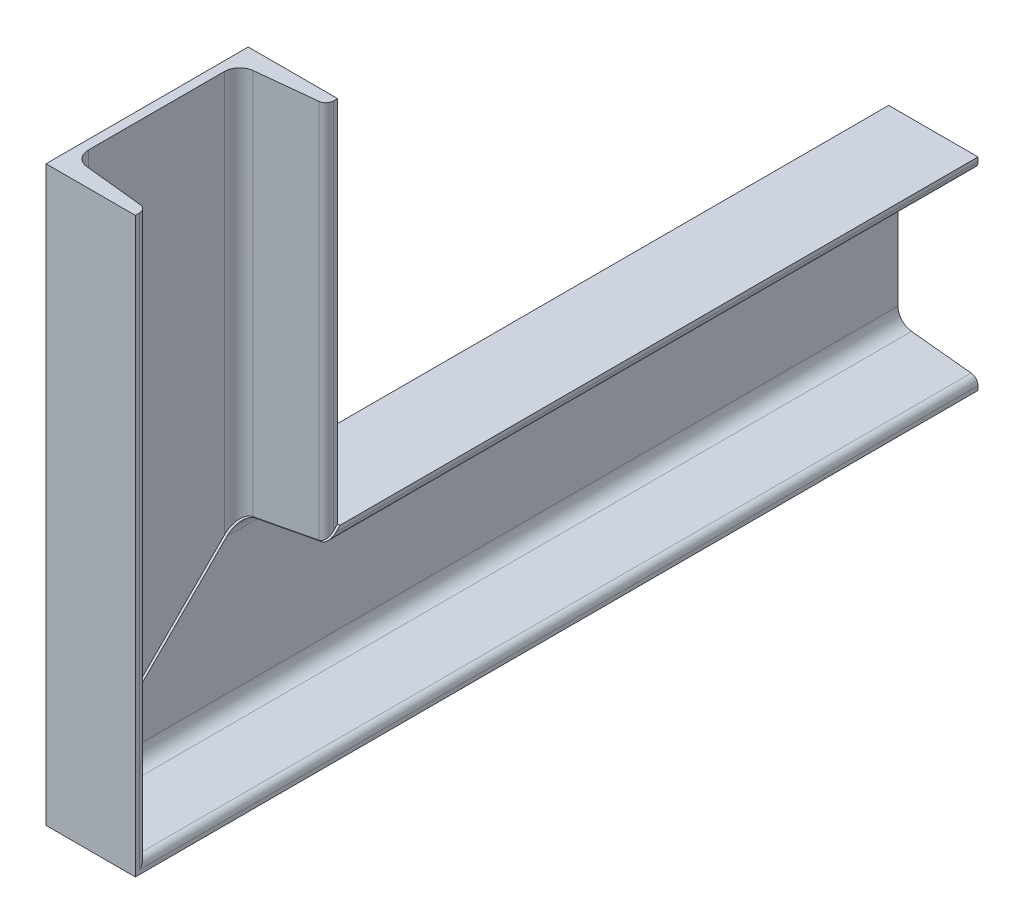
from build123d import *

# Parameters (mm, degrees)
EXTRUDE_1_DEPTH     = 500
EXTRUDE_2_DEPTH     = 340
CUT_EXTRUDE_1_DEPTH = 450
CUT_EXTRUDE_START   = -50
CUT_EXTRUDE_2_DEPTH = 50
CUT_EXTRUDE_3_DEPTH = 60


with BuildPart() as part:
    # Sketch 1 → Extrude 1 (new body)
    with BuildSketch(Plane.XY):
        with BuildLine():
            Line((0, 60), (0, -60))
            Line((0, -60), (53, -60))
            Line((53, -60), (53, -57.551177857))
            ThreePointArc((53, -57.551177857), (51.844388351, -54.540352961), (48.97108153, -53.075903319))
            Line((48.97108153, -53.075903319), (13.557836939, -49.348193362))
            ThreePointArc((13.557836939, -49.348193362), (7.811223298, -46.419294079), (5.5, -40.397644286))
            Line((5.5, -40.397644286), (5.5, 40.397644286))
            ThreePointArc((5.5, 40.397644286), (7.811223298, 46.419294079), (13.557836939, 49.348193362))
            Line((13.557836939, 49.348193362), (48.97108153, 53.075903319))
            ThreePointArc((48.97108153, 53.075903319), (51.844388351, 54.540352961), (53, 57.551177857))
            Line((53, 57.551177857), (53, 60))
            Line((53, 60), (0, 60))
        make_face()
    extrude(amount=EXTRUDE_1_DEPTH)

    # Sketch 2 → Extrude 2 (add)
    with BuildSketch(Plane.XZ.offset(60)):
        with BuildLine():
            Line((0, 500), (0, 380))
            Line((0, 380), (53, 380))
            Line((53, 380), (53, 382.448822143))
            ThreePointArc((53, 382.448822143), (51.844388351, 385.459647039), (48.97108153, 386.924096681))
            Line((48.97108153, 386.924096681), (13.557836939, 390.651806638))
            ThreePointArc((13.557836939, 390.651806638), (7.811223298, 393.580705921), (5.5, 399.602355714))
            Line((5.5, 399.602355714), (5.5, 480.397644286))
            ThreePointArc((5.5, 480.397644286), (7.811223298, 486.419294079), (13.557836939, 489.348193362))
            Line((13.557836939, 489.348193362), (48.97108153, 493.075903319))
            ThreePointArc((48.97108153, 493.075903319), (51.844388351, 494.540352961), (53, 497.551177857))
            Line((53, 497.551177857), (53, 500))
            Line((53, 500), (0, 500))
        make_face()
    extrude(amount=-EXTRUDE_2_DEPTH)

    # Sketch 3 → Cut-Extrude 1 (cut)
    with BuildSketch(Plane(origin=(0, 0, 0), x_dir=(-1, 0, 0), z_dir=(0, 0, -1))):
        with BuildLine():
            Line((-53, 57.551177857), (-53, -57.551177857))
            ThreePointArc((-53, -57.551177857), (-51.844388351, -54.540352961), (-48.97108153, -53.075903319))
            Line((-48.97108153, -53.075903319), (-13.557836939, -49.348193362))
            ThreePointArc((-13.557836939, -49.348193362), (-7.811223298, -46.419294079), (-5.5, -40.397644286))
            Line((-5.5, -40.397644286), (-5.5, 40.397644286))
            ThreePointArc((-5.5, 40.397644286), (-7.811223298, 46.419294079), (-13.557836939, 49.348193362))
            Line((-13.557836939, 49.348193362), (-48.97108153, 53.075903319))
            ThreePointArc((-48.97108153, 53.075903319), (-51.844388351, 54.540352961), (-53, 57.551177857))
        make_face()
    extrude(amount=-CUT_EXTRUDE_1_DEPTH, mode=Mode.SUBTRACT)

    # Sketch 4 → Cut-Extrude 2 (cut)
    with BuildSketch(Plane(origin=(0, 60, 0), x_dir=(-1, 0, 0), z_dir=(0, 1, 0)).offset(CUT_EXTRUDE_START)):
        with BuildLine():
            Line((-13.557836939, 489.348193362), (-48.97108153, 493.075903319))
            ThreePointArc((-48.97108153, 493.075903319), (-51.844388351, 494.540352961), (-53, 497.551177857))
            Line((-53, 497.551177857), (-53, 382.448822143))
            ThreePointArc((-53, 382.448822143), (-51.844388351, 385.459647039), (-48.97108153, 386.924096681))
            Line((-48.97108153, 386.924096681), (-13.557836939, 390.651806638))
            ThreePointArc((-13.557836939, 390.651806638), (-7.811223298, 393.580705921), (-5.5, 399.602355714))
            Line((-5.5, 399.602355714), (-5.5, 480.397644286))
            ThreePointArc((-5.5, 480.397644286), (-7.811223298, 486.419294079), (-13.557836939, 489.348193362))
        make_face()
    extrude(amount=CUT_EXTRUDE_2_DEPTH, mode=Mode.SUBTRACT)

    # Sketch 5 → Cut-Extrude 3 (cut)
    with BuildSketch(Plane.ZY):
        Polygon((480.240947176, -38.826733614), (366.389181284, 75.025032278), (364.974967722, 73.610818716), (478.826733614, -40.240947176), align=None)
    extrude(amount=-CUT_EXTRUDE_3_DEPTH, mode=Mode.SUBTRACT)


solid = part.part
